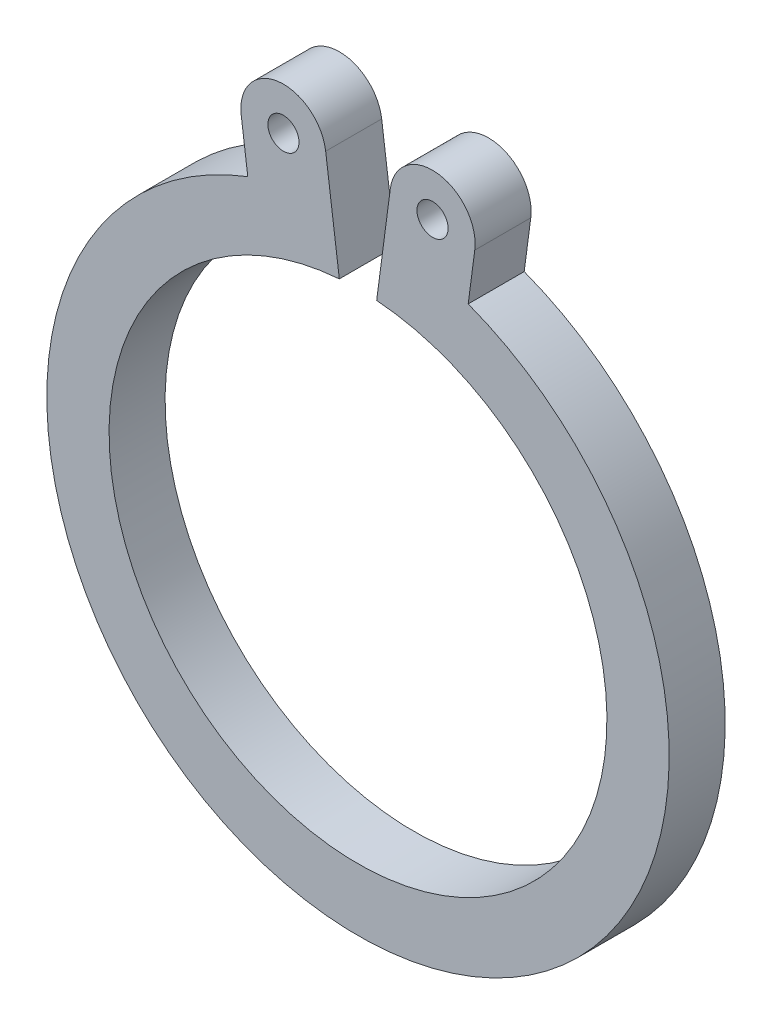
from build123d import *

# Parameters (mm, degrees)
SKETCH1_R          = 0.25
BASE_EXTRUDE_DEPTH = 0.9


with BuildPart() as part:
    # Sketch1 → Base-Extrude (new body)
    with BuildSketch(Plane.XY):
        with BuildLine():
            Line((0.519428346, 5.6554579), (0.3, 3.988734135))
            ThreePointArc((0.3, 3.988734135), (0, -4), (-0.3, 3.988734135))
            Line((-0.3, 3.988734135), (-0.519428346, 5.6554579))
            ThreePointArc((-0.519428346, 5.6554579), (-1.28710542, 6.244517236), (-1.876164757, 5.476840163))
            Line((-1.876164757, 5.476840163), (-1.770725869, 4.675952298))
            ThreePointArc((-1.770725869, 4.675952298), (0, -5), (1.770725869, 4.675952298))
            Line((1.770725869, 4.675952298), (1.876164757, 5.476840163))
            ThreePointArc((1.876164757, 5.476840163), (1.28710542, 6.244517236), (0.519428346, 5.6554579))
        make_face()
        with Locations((1.197796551, 5.566149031)):
            Circle(SKETCH1_R, mode=Mode.SUBTRACT)
        with Locations((-1.197796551, 5.566149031)):
            Circle(SKETCH1_R, mode=Mode.SUBTRACT)
    extrude(amount=BASE_EXTRUDE_DEPTH)


solid = part.part
